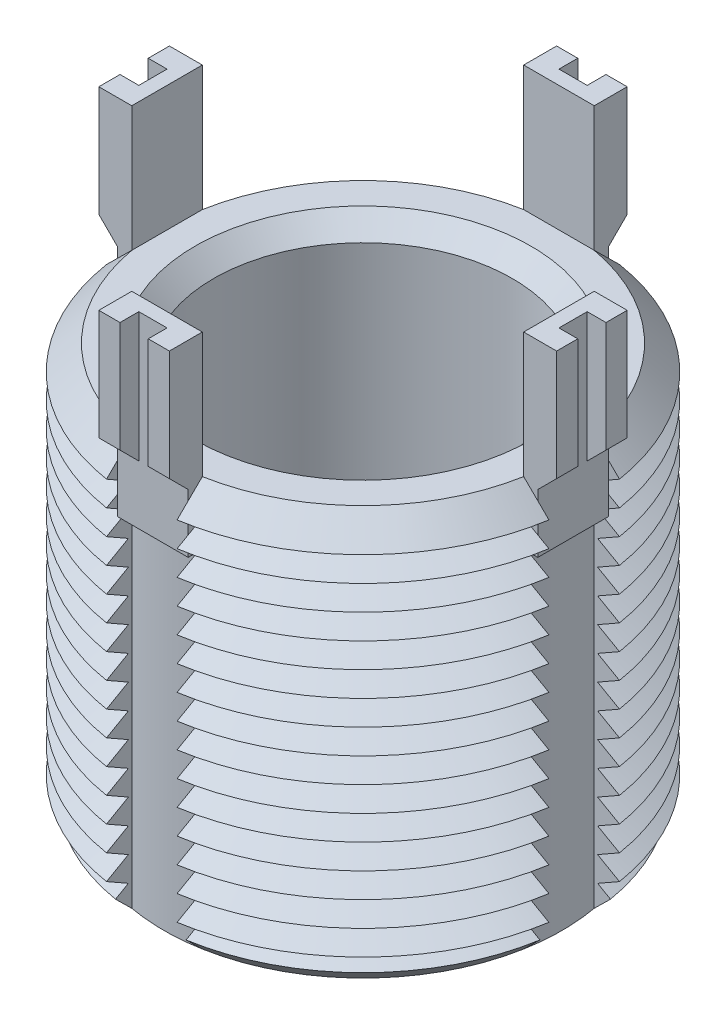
from build123d import *

# Parameters (mm, degrees)
SKETCH1_R               = 19.05
BOSS_EXTRUDE1_DEPTH     = 34.798
CHAMFER1_SIZE           = 2.117
LPATTERN1_COUNT         = 15
LPATTERN1_PITCH         = 2.117
CUT_EXTRUDE1_REACH      = 46.008
CIRPATTERN1_COUNT       = 4
BOSS_EXTRUDE3_DEPTH     = 3
CIRPATTERN2_COUNT       = 4
CUT_EXTRUDE3_DEPTH      = 54.133908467
CUT_EXTRUDE3_DEPTH_BACK = 54.133908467
SKETCH6_W               = 1.6
SKETCH6_H               = 2.4
SKETCH6_W_2             = 2.4
SKETCH6_H_2             = 1.6
SKETCH7_R               = 12.7
CUT_EXTRUDE4_DEPTH      = 34.798
CHAMFER2_SIZE           = 1.5875


with BuildPart() as part:
    # Sketch1 → Boss-Extrude1 (new body)
    with BuildSketch(Plane(origin=(0, 0, 0), x_dir=(1, 0, 0), z_dir=(0, 1, 0))):
        with Locations(Location((0, 0, 0), (0, 0, 270))):
            Circle(SKETCH1_R)
    extrude(amount=-BOSS_EXTRUDE1_DEPTH)

    # Chamfer1
    chamfer1_edges = [part.edges().sort_by_distance(p)[0] for p in [
        (0, 0, -19.05),
        (0, -34.798, -19.05),
    ]]
    chamfer(chamfer1_edges, length=CHAMFER1_SIZE)

    # Sketch3 → Cut-Revolve1 (revolve, cut)
    with BuildSketch(Plane(origin=(0, 0, 0), x_dir=(0, 0, -1), z_dir=(1, 0, 0))):
        Polygon((-19.05, -2.117), (-17.21662422, -3.1755), (-19.05, -4.234), align=None)
    cut_revolve1 = revolve(axis=Axis((0, 0.885892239, 0), (0, -1, 0)), mode=Mode.SUBTRACT)

    # LPattern1: Cut-Revolve1 ×15
    with Locations(*[(0, -i * LPATTERN1_PITCH, 0) for i in range(1, LPATTERN1_COUNT)]):
        add(cut_revolve1, mode=Mode.SUBTRACT)

    # Cut-Extrude1: up to this cone (the profile starts inside it)
    cut_extrude1_end = Plane(origin=(0, 0, 0), z_dir=(0, 1, 0)).offset(-51.730999) * Cone(1e-06, 149.97, 149.969999, align=(Align.CENTER, Align.CENTER, Align.MIN), mode=Mode.PRIVATE)
    # Sketch4 → Cut-Extrude1 (cut, up to the surface)
    with BuildSketch(Plane(origin=(0, 0, 0), x_dir=(1, 0, 0), z_dir=(0, 1, 0)), mode=Mode.PRIVATE) as cut_extrude1_sk1:
        with BuildLine():
            Line((-16.665127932, 3), (-18.812296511, 3))
            ThreePointArc((-18.812296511, 3), (-19.05, 0), (-18.812296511, -3))
            Line((-18.812296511, -3), (-16.665127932, -3))
            ThreePointArc((-16.665127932, -3), (-16.933, 0), (-16.665127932, 3))
        make_face()
    cut_extrude1_tool1 = extrude(cut_extrude1_sk1.sketch, amount=-CUT_EXTRUDE1_REACH, mode=Mode.PRIVATE) & cut_extrude1_end
    cut_extrude1 = cut_extrude1_tool1.solids().sort_by_distance((-17.907162, 0, 0))[0]
    add(cut_extrude1, mode=Mode.SUBTRACT)

    # CirPattern1: Cut-Extrude1 ×4 about axis
    cirpattern1_axis = Axis((0, 0, 0), (0, 1, 0))
    for i in range(1, CIRPATTERN1_COUNT):
        add(cut_extrude1.rotate(cirpattern1_axis, i * 360 / CIRPATTERN1_COUNT), mode=Mode.SUBTRACT)

    # Sketch5 → Boss-Extrude3 (add, symmetric)
    with BuildSketch(Plane(origin=(0, 0, 0), x_dir=(0, 0, -1), z_dir=(1, 0, 0))):
        Polygon((-16.665127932, 10.649), (-16.665127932, -5.351), (-17.865127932, -5.351), (-17.865127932, -0.351), (-19.465127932, 1.249), (-19.465127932, 10.649), align=None)
    boss_extrude3 = extrude(amount=BOSS_EXTRUDE3_DEPTH, both=True)

    # CirPattern2: Boss-Extrude3 ×4 about axis
    cirpattern2_axis = Axis((0, 0, 0), (0, 1, 0))
    for i in range(1, CIRPATTERN2_COUNT):
        add(boss_extrude3.rotate(cirpattern2_axis, i * 360 / CIRPATTERN2_COUNT))

    # Sketch6 → Cut-Extrude3 (cut, two sides: drawn at the far end of the back side and taken through both)
    with BuildSketch(Plane(origin=(0, 10.649, 0), x_dir=(1, 0, 0), z_dir=(0, 1, 0)).offset(-CUT_EXTRUDE3_DEPTH_BACK)):
        with Locations((-18.665127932, 0)):
            Rectangle(SKETCH6_W, SKETCH6_H)
        with Locations((0, 18.665127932)):
            Rectangle(SKETCH6_W_2, SKETCH6_H_2)
        with Locations((18.665127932, 0)):
            Rectangle(SKETCH6_W, SKETCH6_H)
        with Locations((0, -18.665127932)):
            Rectangle(SKETCH6_W_2, SKETCH6_H_2)
    extrude(amount=CUT_EXTRUDE3_DEPTH + CUT_EXTRUDE3_DEPTH_BACK, mode=Mode.SUBTRACT)

    # Sketch7 → Cut-Extrude4 (cut)
    with BuildSketch(Plane(origin=(0, 0, 0), x_dir=(1, 0, 0), z_dir=(0, 1, 0))):
        with Locations(Location((0, 0, 0), (0, 0, 270))):
            Circle(SKETCH7_R)
    extrude(amount=-CUT_EXTRUDE4_DEPTH, mode=Mode.SUBTRACT)

    # Chamfer2
    chamfer2_edges = [part.edges().sort_by_distance(p)[0] for p in [
        (0, 0, -12.7),
        (0, -34.798, -12.7),
    ]]
    chamfer(chamfer2_edges, length=CHAMFER2_SIZE)


solid = part.part
